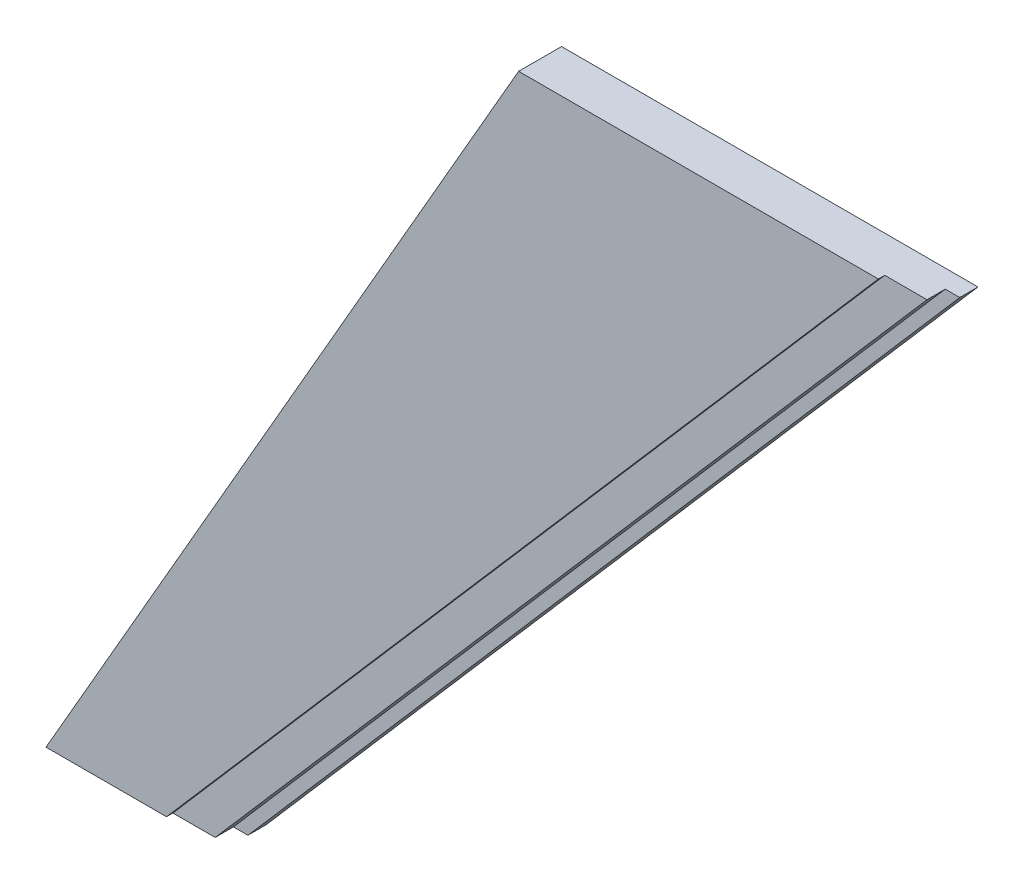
from build123d import *

# Parameters (mm, degrees)
EXTRUDE_1_DEPTH = 47
EXTRUDE_2_DEPTH = 40
EXTRUDE_3_DEPTH = 20


with BuildPart() as part:
    # Sketch 1 → Extrude 1 (new body)
    with BuildSketch(Plane.XY):
        Polygon((-226.783248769, 0), (-620.780305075, 0), (-1138.487052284, -900), (-1006.487052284, -900), align=None)
    extrude(amount=EXTRUDE_1_DEPTH)

    # Sketch 2 → Extrude 2 (add)
    with BuildSketch(Plane(origin=(0, 0, 0), x_dir=(-1, 0, 0), z_dir=(0, 0, -1))):
        Polygon((226.783248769, 0), (180.475447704, 0), (960.179251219, -900), (1006.487052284, -900), align=None)
    extrude(amount=-EXTRUDE_2_DEPTH)

    # Sketch 3 → Extrude 3 (add)
    with BuildSketch(Plane(origin=(0, 0, 0), x_dir=(-1, 0, 0), z_dir=(0, 0, -1))):
        Polygon((180.475447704, 0), (164.598487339, 0), (944.302290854, -900), (960.179251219, -900), align=None)
    extrude(amount=-EXTRUDE_3_DEPTH)


solid = part.part
